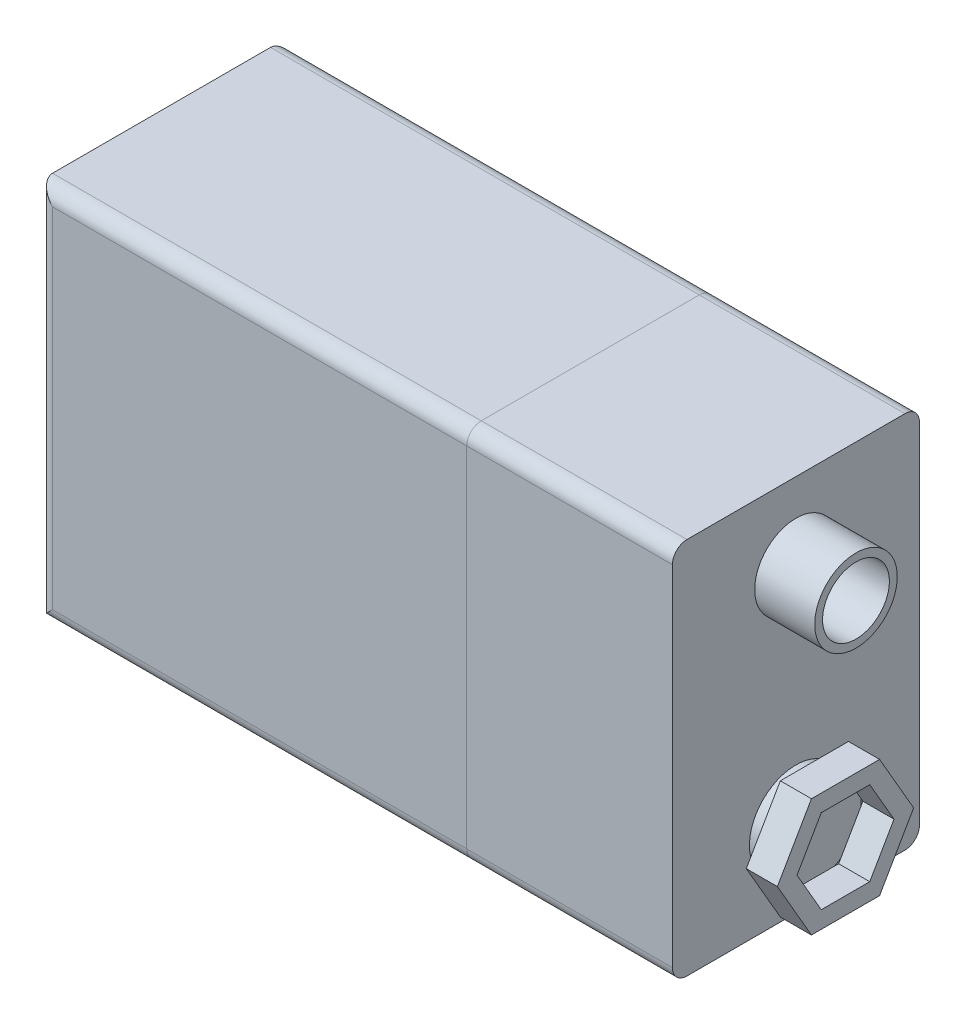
ISO-10303-21;
HEADER;
FILE_DESCRIPTION(('STEP AP214'),'2;1');
FILE_NAME('part.step','',(''),(''),'','','');
FILE_SCHEMA(('AUTOMOTIVE_DESIGN { 1 0 10303 214 1 1 1 1 }'));
ENDSEC;
DATA;
#1=APPLICATION_CONTEXT('core data for automotive mechanical design processes');
#2=APPLICATION_PROTOCOL_DEFINITION('international standard','automotive_design',2000,#1);
#3=PRODUCT_CONTEXT('',#1,'mechanical');
#4=PRODUCT('Part','Part','',(#3));
#5=PRODUCT_RELATED_PRODUCT_CATEGORY('part','',(#4));
#6=PRODUCT_DEFINITION_FORMATION('','',#4);
#7=PRODUCT_DEFINITION_CONTEXT('part definition',#1,'design');
#8=PRODUCT_DEFINITION('design','',#6,#7);
#9=PRODUCT_DEFINITION_SHAPE('','',#8);
#10=(LENGTH_UNIT() NAMED_UNIT(*) SI_UNIT(.MILLI.,.METRE.));
#11=(NAMED_UNIT(*) PLANE_ANGLE_UNIT() SI_UNIT($,.RADIAN.));
#12=(NAMED_UNIT(*) SI_UNIT($,.STERADIAN.) SOLID_ANGLE_UNIT());
#13=UNCERTAINTY_MEASURE_WITH_UNIT(LENGTH_MEASURE(1.E-05),#10,'distance_accuracy_value','');
#14=(GEOMETRIC_REPRESENTATION_CONTEXT(3) GLOBAL_UNCERTAINTY_ASSIGNED_CONTEXT((#13)) GLOBAL_UNIT_ASSIGNED_CONTEXT((#10,
#11,#12)) REPRESENTATION_CONTEXT('',''));
#15=CARTESIAN_POINT('',(0.,0.,0.));
#16=DIRECTION('',(0.,0.,1.));
#17=DIRECTION('',(1.,0.,0.));
#18=AXIS2_PLACEMENT_3D('',#15,#16,#17);
#19=CARTESIAN_POINT('',(44.92,5.63,-8.5));
#20=DIRECTION('',(1.,0.,0.));
#21=DIRECTION('',(0.,0.,-1.));
#22=AXIS2_PLACEMENT_3D('',#19,#20,#21);
#23=PLANE('',#22);
#24=CARTESIAN_POINT('',(44.92,5.63,-8.5));
#25=DIRECTION('',(1.,0.,0.));
#26=DIRECTION('',(0.,0.,-1.));
#27=AXIS2_PLACEMENT_3D('',#24,#25,#26);
#28=CIRCLE('',#27,3.2);
#29=CARTESIAN_POINT('',(44.92,2.74,-9.8740087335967));
#30=VERTEX_POINT('',#29);
#31=CARTESIAN_POINT('',(44.92,2.99507353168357,-10.3158090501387));
#32=VERTEX_POINT('',#31);
#33=EDGE_CURVE('E835',#30,#32,#28,.T.);
#34=ORIENTED_EDGE('',*,*,#33,.T.);
#35=DIRECTION('',(0.,0.866025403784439,-0.5));
#36=VECTOR('',#35,1.);
#37=CARTESIAN_POINT('',(44.92,2.74,-10.168542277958));
#38=LINE('',#37,#36);
#39=CARTESIAN_POINT('',(44.92,5.37492646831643,-11.6898177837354));
#40=VERTEX_POINT('',#39);
#41=EDGE_CURVE('E278',#32,#40,#38,.T.);
#42=ORIENTED_EDGE('',*,*,#41,.T.);
#43=CARTESIAN_POINT('',(44.92,5.88507353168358,-11.6898177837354));
#44=VERTEX_POINT('',#43);
#45=EDGE_CURVE('E360',#40,#44,#28,.T.);
#46=ORIENTED_EDGE('',*,*,#45,.T.);
#47=DIRECTION('',(0.,0.866025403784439,0.5));
#48=VECTOR('',#47,1.);
#49=CARTESIAN_POINT('',(44.92,5.63,-11.837084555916));
#50=LINE('',#49,#48);
#51=CARTESIAN_POINT('',(44.92,8.26492646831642,-10.3158090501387));
#52=VERTEX_POINT('',#51);
#53=EDGE_CURVE('E281',#44,#52,#50,.T.);
#54=ORIENTED_EDGE('',*,*,#53,.T.);
#55=CARTESIAN_POINT('',(44.92,8.52,-9.8740087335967));
#56=VERTEX_POINT('',#55);
#57=EDGE_CURVE('E359',#52,#56,#28,.T.);
#58=ORIENTED_EDGE('',*,*,#57,.T.);
#59=DIRECTION('',(0.,0.,1.));
#60=VECTOR('',#59,1.);
#61=CARTESIAN_POINT('',(44.92,8.52,-10.168542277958));
#62=LINE('',#61,#60);
#63=CARTESIAN_POINT('',(44.92,8.52,-7.12599126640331));
#64=VERTEX_POINT('',#63);
#65=EDGE_CURVE('E286',#56,#64,#62,.T.);
#66=ORIENTED_EDGE('',*,*,#65,.T.);
#67=CARTESIAN_POINT('',(44.92,8.26492646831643,-6.68419094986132));
#68=VERTEX_POINT('',#67);
#69=EDGE_CURVE('E816',#64,#68,#28,.T.);
#70=ORIENTED_EDGE('',*,*,#69,.T.);
#71=DIRECTION('',(0.,-0.866025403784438,0.5));
#72=VECTOR('',#71,1.);
#73=CARTESIAN_POINT('',(44.92,8.52,-6.83145772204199));
#74=LINE('',#73,#72);
#75=CARTESIAN_POINT('',(44.92,5.88507353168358,-5.31018221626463));
#76=VERTEX_POINT('',#75);
#77=EDGE_CURVE('E291',#68,#76,#74,.T.);
#78=ORIENTED_EDGE('',*,*,#77,.T.);
#79=CARTESIAN_POINT('',(44.92,5.37492646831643,-5.31018221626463));
#80=VERTEX_POINT('',#79);
#81=EDGE_CURVE('E821',#76,#80,#28,.T.);
#82=ORIENTED_EDGE('',*,*,#81,.T.);
#83=DIRECTION('',(0.,-0.866025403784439,-0.5));
#84=VECTOR('',#83,1.);
#85=CARTESIAN_POINT('',(44.92,5.63,-5.16291544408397));
#86=LINE('',#85,#84);
#87=CARTESIAN_POINT('',(44.92,2.99507353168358,-6.68419094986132));
#88=VERTEX_POINT('',#87);
#89=EDGE_CURVE('E296',#80,#88,#86,.T.);
#90=ORIENTED_EDGE('',*,*,#89,.T.);
#91=CARTESIAN_POINT('',(44.92,2.74,-7.1259912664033));
#92=VERTEX_POINT('',#91);
#93=EDGE_CURVE('E828',#88,#92,#28,.T.);
#94=ORIENTED_EDGE('',*,*,#93,.T.);
#95=DIRECTION('',(0.,0.,-1.));
#96=VECTOR('',#95,1.);
#97=CARTESIAN_POINT('',(44.92,2.74,-6.83145772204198));
#98=LINE('',#97,#96);
#99=EDGE_CURVE('E299',#92,#30,#98,.T.);
#100=ORIENTED_EDGE('',*,*,#99,.T.);
#101=EDGE_LOOP('',(#34,#42,#46,#54,#58,#66,#70,#78,#82,#90,#94,#100));
#102=FACE_BOUND('',#101,.T.);
#103=ADVANCED_FACE('F61',(#102),#23,.T.);
#104=CARTESIAN_POINT('',(43.65,26.008,0.));
#105=DIRECTION('',(0.,0.,-1.));
#106=DIRECTION('',(-1.,0.,0.));
#107=AXIS2_PLACEMENT_3D('',#104,#105,#106);
#108=PLANE('',#107);
#109=DIRECTION('',(0.,-1.,0.));
#110=VECTOR('',#109,1.);
#111=CARTESIAN_POINT('',(29.5,26.008,0.));
#112=LINE('',#111,#110);
#113=CARTESIAN_POINT('',(29.5,25.008,0.));
#114=VERTEX_POINT('',#113);
#115=CARTESIAN_POINT('',(29.5,1.,0.));
#116=VERTEX_POINT('',#115);
#117=EDGE_CURVE('E369',#114,#116,#112,.T.);
#118=ORIENTED_EDGE('',*,*,#117,.T.);
#119=DIRECTION('',(-1.,0.,0.));
#120=VECTOR('',#119,1.);
#121=CARTESIAN_POINT('',(43.65,1.,0.));
#122=LINE('',#121,#120);
#123=CARTESIAN_POINT('',(43.65,1.,0.));
#124=VERTEX_POINT('',#123);
#125=EDGE_CURVE('E411',#116,#124,#122,.F.);
#126=ORIENTED_EDGE('',*,*,#125,.T.);
#127=DIRECTION('',(0.,-1.,0.));
#128=VECTOR('',#127,1.);
#129=CARTESIAN_POINT('',(43.65,26.008,0.));
#130=LINE('',#129,#128);
#131=CARTESIAN_POINT('',(43.65,25.008,0.));
#132=VERTEX_POINT('',#131);
#133=EDGE_CURVE('E372',#132,#124,#130,.T.);
#134=ORIENTED_EDGE('',*,*,#133,.F.);
#135=DIRECTION('',(-1.,0.,0.));
#136=VECTOR('',#135,1.);
#137=CARTESIAN_POINT('',(43.65,25.008,0.));
#138=LINE('',#137,#136);
#139=EDGE_CURVE('E408',#132,#114,#138,.T.);
#140=ORIENTED_EDGE('',*,*,#139,.T.);
#141=EDGE_LOOP('',(#118,#126,#134,#140));
#142=FACE_BOUND('',#141,.T.);
#143=ADVANCED_FACE('F447',(#142),#108,.F.);
#144=CARTESIAN_POINT('',(43.65,0.,0.));
#145=DIRECTION('',(0.,1.,0.));
#146=DIRECTION('',(0.,0.,1.));
#147=AXIS2_PLACEMENT_3D('',#144,#145,#146);
#148=PLANE('',#147);
#149=DIRECTION('',(0.,0.,-1.));
#150=VECTOR('',#149,1.);
#151=CARTESIAN_POINT('',(43.65,0.,0.));
#152=LINE('',#151,#150);
#153=CARTESIAN_POINT('',(43.65,0.,-1.));
#154=VERTEX_POINT('',#153);
#155=CARTESIAN_POINT('',(43.65,0.,-16.));
#156=VERTEX_POINT('',#155);
#157=EDGE_CURVE('E375',#154,#156,#152,.T.);
#158=ORIENTED_EDGE('',*,*,#157,.F.);
#159=DIRECTION('',(-1.,0.,0.));
#160=VECTOR('',#159,1.);
#161=CARTESIAN_POINT('',(43.65,0.,-1.));
#162=LINE('',#161,#160);
#163=CARTESIAN_POINT('',(29.5,0.,-1.));
#164=VERTEX_POINT('',#163);
#165=EDGE_CURVE('E397',#154,#164,#162,.T.);
#166=ORIENTED_EDGE('',*,*,#165,.T.);
#167=DIRECTION('',(0.,0.,-1.));
#168=VECTOR('',#167,1.);
#169=CARTESIAN_POINT('',(29.5,0.,0.));
#170=LINE('',#169,#168);
#171=CARTESIAN_POINT('',(29.5,0.,-16.));
#172=VERTEX_POINT('',#171);
#173=EDGE_CURVE('E386',#164,#172,#170,.T.);
#174=ORIENTED_EDGE('',*,*,#173,.T.);
#175=DIRECTION('',(-1.,0.,0.));
#176=VECTOR('',#175,1.);
#177=CARTESIAN_POINT('',(43.65,0.,-16.));
#178=LINE('',#177,#176);
#179=EDGE_CURVE('E395',#172,#156,#178,.F.);
#180=ORIENTED_EDGE('',*,*,#179,.T.);
#181=EDGE_LOOP('',(#158,#166,#174,#180));
#182=FACE_BOUND('',#181,.T.);
#183=ADVANCED_FACE('F455',(#182),#148,.F.);
#184=CARTESIAN_POINT('',(43.65,26.008,-17.));
#185=DIRECTION('',(0.,0.,1.));
#186=DIRECTION('',(1.,0.,0.));
#187=AXIS2_PLACEMENT_3D('',#184,#185,#186);
#188=PLANE('',#187);
#189=DIRECTION('',(0.,1.,0.));
#190=VECTOR('',#189,1.);
#191=CARTESIAN_POINT('',(43.65,26.008,-17.));
#192=LINE('',#191,#190);
#193=CARTESIAN_POINT('',(43.65,1.,-17.));
#194=VERTEX_POINT('',#193);
#195=CARTESIAN_POINT('',(43.65,25.008,-17.));
#196=VERTEX_POINT('',#195);
#197=EDGE_CURVE('E379',#194,#196,#192,.T.);
#198=ORIENTED_EDGE('',*,*,#197,.F.);
#199=DIRECTION('',(-1.,0.,0.));
#200=VECTOR('',#199,1.);
#201=CARTESIAN_POINT('',(43.65,1.,-17.));
#202=LINE('',#201,#200);
#203=CARTESIAN_POINT('',(29.5,1.,-17.));
#204=VERTEX_POINT('',#203);
#205=EDGE_CURVE('E422',#194,#204,#202,.T.);
#206=ORIENTED_EDGE('',*,*,#205,.T.);
#207=DIRECTION('',(0.,1.,0.));
#208=VECTOR('',#207,1.);
#209=CARTESIAN_POINT('',(29.5,26.008,-17.));
#210=LINE('',#209,#208);
#211=CARTESIAN_POINT('',(29.5,25.008,-17.));
#212=VERTEX_POINT('',#211);
#213=EDGE_CURVE('E389',#204,#212,#210,.T.);
#214=ORIENTED_EDGE('',*,*,#213,.T.);
#215=DIRECTION('',(-1.,0.,0.));
#216=VECTOR('',#215,1.);
#217=CARTESIAN_POINT('',(43.65,25.008,-17.));
#218=LINE('',#217,#216);
#219=EDGE_CURVE('E420',#212,#196,#218,.F.);
#220=ORIENTED_EDGE('',*,*,#219,.T.);
#221=EDGE_LOOP('',(#198,#206,#214,#220));
#222=FACE_BOUND('',#221,.T.);
#223=ADVANCED_FACE('F428',(#222),#188,.F.);
#224=CARTESIAN_POINT('',(43.65,26.008,0.));
#225=DIRECTION('',(0.,-1.,0.));
#226=DIRECTION('',(0.,0.,-1.));
#227=AXIS2_PLACEMENT_3D('',#224,#225,#226);
#228=PLANE('',#227);
#229=DIRECTION('',(0.,0.,1.));
#230=VECTOR('',#229,1.);
#231=CARTESIAN_POINT('',(43.65,26.008,0.));
#232=LINE('',#231,#230);
#233=CARTESIAN_POINT('',(43.65,26.008,-16.));
#234=VERTEX_POINT('',#233);
#235=CARTESIAN_POINT('',(43.65,26.008,-1.));
#236=VERTEX_POINT('',#235);
#237=EDGE_CURVE('E381',#234,#236,#232,.T.);
#238=ORIENTED_EDGE('',*,*,#237,.F.);
#239=DIRECTION('',(-1.,0.,0.));
#240=VECTOR('',#239,1.);
#241=CARTESIAN_POINT('',(43.65,26.008,-16.));
#242=LINE('',#241,#240);
#243=CARTESIAN_POINT('',(29.5,26.008,-16.));
#244=VERTEX_POINT('',#243);
#245=EDGE_CURVE('E12',#234,#244,#242,.T.);
#246=ORIENTED_EDGE('',*,*,#245,.T.);
#247=DIRECTION('',(0.,0.,1.));
#248=VECTOR('',#247,1.);
#249=CARTESIAN_POINT('',(29.5,26.008,0.));
#250=LINE('',#249,#248);
#251=CARTESIAN_POINT('',(29.5,26.008,-1.));
#252=VERTEX_POINT('',#251);
#253=EDGE_CURVE('E376',#244,#252,#250,.T.);
#254=ORIENTED_EDGE('',*,*,#253,.T.);
#255=DIRECTION('',(-1.,0.,0.));
#256=VECTOR('',#255,1.);
#257=CARTESIAN_POINT('',(43.65,26.008,-1.));
#258=LINE('',#257,#256);
#259=EDGE_CURVE('E69',#252,#236,#258,.F.);
#260=ORIENTED_EDGE('',*,*,#259,.T.);
#261=EDGE_LOOP('',(#238,#246,#254,#260));
#262=FACE_BOUND('',#261,.T.);
#263=ADVANCED_FACE('F439',(#262),#228,.F.);
#264=CARTESIAN_POINT('',(43.65,0.,0.));
#265=DIRECTION('',(1.,0.,0.));
#266=DIRECTION('',(0.,0.,-1.));
#267=AXIS2_PLACEMENT_3D('',#264,#265,#266);
#268=PLANE('',#267);
#269=CARTESIAN_POINT('',(43.65,5.63,-8.5));
#270=DIRECTION('',(1.,0.,0.));
#271=DIRECTION('',(0.,0.,-1.));
#272=AXIS2_PLACEMENT_3D('',#269,#270,#271);
#273=CIRCLE('',#272,3.2);
#274=CARTESIAN_POINT('',(43.65,5.63,-11.7));
#275=VERTEX_POINT('',#274);
#276=EDGE_CURVE('E354',#275,#275,#273,.T.);
#277=ORIENTED_EDGE('',*,*,#276,.F.);
#278=EDGE_LOOP('',(#277));
#279=FACE_BOUND('',#278,.T.);
#280=CARTESIAN_POINT('',(43.65,20.688,-8.5));
#281=DIRECTION('',(1.,0.,0.));
#282=DIRECTION('',(0.,0.,-1.));
#283=AXIS2_PLACEMENT_3D('',#280,#281,#282);
#284=CIRCLE('',#283,2.84);
#285=CARTESIAN_POINT('',(43.65,20.688,-11.34));
#286=VERTEX_POINT('',#285);
#287=EDGE_CURVE('E365',#286,#286,#284,.T.);
#288=ORIENTED_EDGE('',*,*,#287,.F.);
#289=EDGE_LOOP('',(#288));
#290=FACE_BOUND('',#289,.T.);
#291=ORIENTED_EDGE('',*,*,#133,.T.);
#292=CARTESIAN_POINT('',(43.65,1.,-1.));
#293=DIRECTION('',(1.,0.,0.));
#294=DIRECTION('',(0.,0.,-1.));
#295=AXIS2_PLACEMENT_3D('',#292,#293,#294);
#296=CIRCLE('',#295,1.);
#297=EDGE_CURVE('E418',#124,#154,#296,.T.);
#298=ORIENTED_EDGE('',*,*,#297,.T.);
#299=ORIENTED_EDGE('',*,*,#157,.T.);
#300=CARTESIAN_POINT('',(43.65,1.,-16.));
#301=DIRECTION('',(1.,0.,0.));
#302=DIRECTION('',(0.,0.,-1.));
#303=AXIS2_PLACEMENT_3D('',#300,#301,#302);
#304=CIRCLE('',#303,1.);
#305=EDGE_CURVE('E416',#156,#194,#304,.T.);
#306=ORIENTED_EDGE('',*,*,#305,.T.);
#307=ORIENTED_EDGE('',*,*,#197,.T.);
#308=CARTESIAN_POINT('',(43.65,25.008,-16.));
#309=DIRECTION('',(1.,0.,0.));
#310=DIRECTION('',(0.,0.,-1.));
#311=AXIS2_PLACEMENT_3D('',#308,#309,#310);
#312=CIRCLE('',#311,1.);
#313=EDGE_CURVE('E82',#196,#234,#312,.T.);
#314=ORIENTED_EDGE('',*,*,#313,.T.);
#315=ORIENTED_EDGE('',*,*,#237,.T.);
#316=CARTESIAN_POINT('',(43.65,25.008,-1.));
#317=DIRECTION('',(1.,0.,0.));
#318=DIRECTION('',(0.,0.,-1.));
#319=AXIS2_PLACEMENT_3D('',#316,#317,#318);
#320=CIRCLE('',#319,1.);
#321=EDGE_CURVE('E413',#236,#132,#320,.T.);
#322=ORIENTED_EDGE('',*,*,#321,.T.);
#323=EDGE_LOOP('',(#291,#298,#299,#306,#307,#314,#315,#322));
#324=FACE_BOUND('',#323,.T.);
#325=ADVANCED_FACE('F441',(#279,#290,#324),#268,.T.);
#326=CARTESIAN_POINT('',(29.5,0.,0.));
#327=DIRECTION('',(1.,0.,0.));
#328=DIRECTION('',(0.,0.,-1.));
#329=AXIS2_PLACEMENT_3D('',#326,#327,#328);
#330=PLANE('',#329);
#331=ORIENTED_EDGE('',*,*,#173,.F.);
#332=CARTESIAN_POINT('',(29.5,1.,-1.));
#333=DIRECTION('',(1.,0.,0.));
#334=DIRECTION('',(0.,0.,-1.));
#335=AXIS2_PLACEMENT_3D('',#332,#333,#334);
#336=CIRCLE('',#335,1.);
#337=EDGE_CURVE('E406',#164,#116,#336,.F.);
#338=ORIENTED_EDGE('',*,*,#337,.T.);
#339=ORIENTED_EDGE('',*,*,#117,.F.);
#340=CARTESIAN_POINT('',(29.5,25.008,-1.));
#341=DIRECTION('',(1.,0.,0.));
#342=DIRECTION('',(0.,0.,-1.));
#343=AXIS2_PLACEMENT_3D('',#340,#341,#342);
#344=CIRCLE('',#343,1.);
#345=EDGE_CURVE('E400',#114,#252,#344,.F.);
#346=ORIENTED_EDGE('',*,*,#345,.T.);
#347=ORIENTED_EDGE('',*,*,#253,.F.);
#348=CARTESIAN_POINT('',(29.5,25.008,-16.));
#349=DIRECTION('',(1.,0.,0.));
#350=DIRECTION('',(0.,0.,-1.));
#351=AXIS2_PLACEMENT_3D('',#348,#349,#350);
#352=CIRCLE('',#351,1.);
#353=EDGE_CURVE('E402',#244,#212,#352,.F.);
#354=ORIENTED_EDGE('',*,*,#353,.T.);
#355=ORIENTED_EDGE('',*,*,#213,.F.);
#356=CARTESIAN_POINT('',(29.5,1.,-16.));
#357=DIRECTION('',(1.,0.,0.));
#358=DIRECTION('',(0.,0.,-1.));
#359=AXIS2_PLACEMENT_3D('',#356,#357,#358);
#360=CIRCLE('',#359,1.);
#361=EDGE_CURVE('E404',#204,#172,#360,.F.);
#362=ORIENTED_EDGE('',*,*,#361,.T.);
#363=EDGE_LOOP('',(#331,#338,#339,#346,#347,#354,#355,#362));
#364=FACE_BOUND('',#363,.T.);
#365=ADVANCED_FACE('F434',(#364),#330,.F.);
#366=CARTESIAN_POINT('',(47.78,20.688,-8.5));
#367=DIRECTION('',(1.,0.,0.));
#368=DIRECTION('',(0.,0.,-1.));
#369=AXIS2_PLACEMENT_3D('',#366,#367,#368);
#370=PLANE('',#369);
#371=CARTESIAN_POINT('',(47.78,20.688,-8.5));
#372=DIRECTION('',(1.,0.,0.));
#373=DIRECTION('',(0.,0.,-1.));
#374=AXIS2_PLACEMENT_3D('',#371,#372,#373);
#375=CIRCLE('',#374,2.84);
#376=CARTESIAN_POINT('',(47.78,20.688,-11.34));
#377=VERTEX_POINT('',#376);
#378=EDGE_CURVE('E366',#377,#377,#375,.T.);
#379=ORIENTED_EDGE('',*,*,#378,.T.);
#380=EDGE_LOOP('',(#379));
#381=FACE_BOUND('',#380,.T.);
#382=CARTESIAN_POINT('',(47.78,20.688,-8.5));
#383=DIRECTION('',(1.,0.,0.));
#384=DIRECTION('',(0.,0.,-1.));
#385=AXIS2_PLACEMENT_3D('',#382,#383,#384);
#386=CIRCLE('',#385,2.3);
#387=CARTESIAN_POINT('',(47.78,20.688,-10.8));
#388=VERTEX_POINT('',#387);
#389=EDGE_CURVE('E358',#388,#388,#386,.T.);
#390=ORIENTED_EDGE('',*,*,#389,.F.);
#391=EDGE_LOOP('',(#390));
#392=FACE_BOUND('',#391,.T.);
#393=ADVANCED_FACE('F489',(#381,#392),#370,.T.);
#394=CARTESIAN_POINT('',(47.78,20.688,-8.5));
#395=DIRECTION('',(-1.,0.,0.));
#396=DIRECTION('',(0.,0.,1.));
#397=AXIS2_PLACEMENT_3D('',#394,#395,#396);
#398=CYLINDRICAL_SURFACE('',#397,2.84);
#399=ORIENTED_EDGE('',*,*,#378,.F.);
#400=EDGE_LOOP('',(#399));
#401=FACE_BOUND('',#400,.T.);
#402=ORIENTED_EDGE('',*,*,#287,.T.);
#403=EDGE_LOOP('',(#402));
#404=FACE_BOUND('',#403,.T.);
#405=ADVANCED_FACE('F487',(#401,#404),#398,.T.);
#406=CARTESIAN_POINT('',(47.78,20.688,-8.5));
#407=DIRECTION('',(-1.,0.,0.));
#408=DIRECTION('',(0.,0.,1.));
#409=AXIS2_PLACEMENT_3D('',#406,#407,#408);
#410=CYLINDRICAL_SURFACE('',#409,2.3);
#411=ORIENTED_EDGE('',*,*,#389,.T.);
#412=EDGE_LOOP('',(#411));
#413=FACE_BOUND('',#412,.T.);
#414=CARTESIAN_POINT('',(43.65,20.688,-8.5));
#415=DIRECTION('',(1.,0.,0.));
#416=DIRECTION('',(0.,0.,-1.));
#417=AXIS2_PLACEMENT_3D('',#414,#415,#416);
#418=CIRCLE('',#417,2.3);
#419=CARTESIAN_POINT('',(43.65,20.688,-10.8));
#420=VERTEX_POINT('',#419);
#421=EDGE_CURVE('E383',#420,#420,#418,.F.);
#422=ORIENTED_EDGE('',*,*,#421,.T.);
#423=EDGE_LOOP('',(#422));
#424=FACE_BOUND('',#423,.T.);
#425=ADVANCED_FACE('F484',(#413,#424),#410,.F.);
#426=ORIENTED_EDGE('',*,*,#421,.F.);
#427=EDGE_LOOP('',(#426));
#428=FACE_BOUND('',#427,.T.);
#429=ADVANCED_FACE('F482',(#428),#268,.T.);
#430=CARTESIAN_POINT('',(44.92,5.63,-8.5));
#431=DIRECTION('',(-1.,0.,0.));
#432=DIRECTION('',(0.,0.,1.));
#433=AXIS2_PLACEMENT_3D('',#430,#431,#432);
#434=CYLINDRICAL_SURFACE('',#433,3.2);
#435=EDGE_CURVE('E355',#44,#52,#28,.T.);
#436=ORIENTED_EDGE('',*,*,#435,.F.);
#437=ORIENTED_EDGE('',*,*,#45,.F.);
#438=EDGE_CURVE('E809',#32,#40,#28,.T.);
#439=ORIENTED_EDGE('',*,*,#438,.F.);
#440=ORIENTED_EDGE('',*,*,#33,.F.);
#441=EDGE_CURVE('E831',#92,#30,#28,.T.);
#442=ORIENTED_EDGE('',*,*,#441,.F.);
#443=ORIENTED_EDGE('',*,*,#93,.F.);
#444=EDGE_CURVE('E824',#80,#88,#28,.T.);
#445=ORIENTED_EDGE('',*,*,#444,.F.);
#446=ORIENTED_EDGE('',*,*,#81,.F.);
#447=EDGE_CURVE('E818',#68,#76,#28,.T.);
#448=ORIENTED_EDGE('',*,*,#447,.F.);
#449=ORIENTED_EDGE('',*,*,#69,.F.);
#450=EDGE_CURVE('E814',#56,#64,#28,.T.);
#451=ORIENTED_EDGE('',*,*,#450,.F.);
#452=ORIENTED_EDGE('',*,*,#57,.F.);
#453=EDGE_LOOP('',(#436,#437,#439,#440,#442,#443,#445,#446,#448,#449,#451,#452));
#454=FACE_BOUND('',#453,.T.);
#455=ORIENTED_EDGE('',*,*,#276,.T.);
#456=EDGE_LOOP('',(#455));
#457=FACE_BOUND('',#456,.T.);
#458=ADVANCED_FACE('F478',(#454,#457),#434,.T.);
#459=CARTESIAN_POINT('',(44.92,0.,0.));
#460=DIRECTION('',(1.,0.,0.));
#461=DIRECTION('',(0.,0.,-1.));
#462=AXIS2_PLACEMENT_3D('',#459,#460,#461);
#463=PLANE('',#462);
#464=DIRECTION('',(0.,0.866025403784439,-0.5));
#465=VECTOR('',#464,1.);
#466=CARTESIAN_POINT('',(44.92,1.57,-10.8440420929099));
#467=LINE('',#466,#465);
#468=CARTESIAN_POINT('',(44.92,1.57,-10.8440420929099));
#469=VERTEX_POINT('',#468);
#470=CARTESIAN_POINT('',(44.92,5.63,-13.1880841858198));
#471=VERTEX_POINT('',#470);
#472=EDGE_CURVE('E256',#469,#471,#467,.T.);
#473=ORIENTED_EDGE('',*,*,#472,.F.);
#474=DIRECTION('',(0.,0.,-1.));
#475=VECTOR('',#474,1.);
#476=CARTESIAN_POINT('',(44.92,1.57,-6.15595790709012));
#477=LINE('',#476,#475);
#478=CARTESIAN_POINT('',(44.92,1.57,-6.15595790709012));
#479=VERTEX_POINT('',#478);
#480=EDGE_CURVE('E315',#479,#469,#477,.T.);
#481=ORIENTED_EDGE('',*,*,#480,.F.);
#482=DIRECTION('',(0.,-0.866025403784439,-0.5));
#483=VECTOR('',#482,1.);
#484=CARTESIAN_POINT('',(44.92,5.63,-3.81191581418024));
#485=LINE('',#484,#483);
#486=CARTESIAN_POINT('',(44.92,5.63,-3.81191581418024));
#487=VERTEX_POINT('',#486);
#488=EDGE_CURVE('E334',#487,#479,#485,.T.);
#489=ORIENTED_EDGE('',*,*,#488,.F.);
#490=DIRECTION('',(0.,-0.866025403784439,0.5));
#491=VECTOR('',#490,1.);
#492=CARTESIAN_POINT('',(44.92,9.69,-6.15595790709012));
#493=LINE('',#492,#491);
#494=CARTESIAN_POINT('',(44.92,9.69,-6.15595790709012));
#495=VERTEX_POINT('',#494);
#496=EDGE_CURVE('E332',#495,#487,#493,.T.);
#497=ORIENTED_EDGE('',*,*,#496,.F.);
#498=DIRECTION('',(0.,0.,1.));
#499=VECTOR('',#498,1.);
#500=CARTESIAN_POINT('',(44.92,9.69,-10.8440420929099));
#501=LINE('',#500,#499);
#502=CARTESIAN_POINT('',(44.92,9.69,-10.8440420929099));
#503=VERTEX_POINT('',#502);
#504=EDGE_CURVE('E330',#503,#495,#501,.T.);
#505=ORIENTED_EDGE('',*,*,#504,.F.);
#506=DIRECTION('',(0.,0.866025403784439,0.5));
#507=VECTOR('',#506,1.);
#508=CARTESIAN_POINT('',(44.92,5.63,-13.1880841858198));
#509=LINE('',#508,#507);
#510=EDGE_CURVE('E328',#471,#503,#509,.T.);
#511=ORIENTED_EDGE('',*,*,#510,.F.);
#512=EDGE_LOOP('',(#473,#481,#489,#497,#505,#511));
#513=FACE_BOUND('',#512,.T.);
#514=CARTESIAN_POINT('',(44.92,5.63,-11.837084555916));
#515=VERTEX_POINT('',#514);
#516=EDGE_CURVE('E255',#515,#44,#50,.T.);
#517=ORIENTED_EDGE('',*,*,#516,.T.);
#518=ORIENTED_EDGE('',*,*,#435,.T.);
#519=CARTESIAN_POINT('',(44.92,8.52,-10.168542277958));
#520=VERTEX_POINT('',#519);
#521=EDGE_CURVE('E276',#52,#520,#50,.T.);
#522=ORIENTED_EDGE('',*,*,#521,.T.);
#523=EDGE_CURVE('E282',#520,#56,#62,.T.);
#524=ORIENTED_EDGE('',*,*,#523,.T.);
#525=ORIENTED_EDGE('',*,*,#450,.T.);
#526=CARTESIAN_POINT('',(44.92,8.52,-6.83145772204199));
#527=VERTEX_POINT('',#526);
#528=EDGE_CURVE('E280',#64,#527,#62,.T.);
#529=ORIENTED_EDGE('',*,*,#528,.T.);
#530=EDGE_CURVE('E287',#527,#68,#74,.T.);
#531=ORIENTED_EDGE('',*,*,#530,.T.);
#532=ORIENTED_EDGE('',*,*,#447,.T.);
#533=CARTESIAN_POINT('',(44.92,5.63,-5.16291544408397));
#534=VERTEX_POINT('',#533);
#535=EDGE_CURVE('E285',#76,#534,#74,.T.);
#536=ORIENTED_EDGE('',*,*,#535,.T.);
#537=EDGE_CURVE('E292',#534,#80,#86,.T.);
#538=ORIENTED_EDGE('',*,*,#537,.T.);
#539=ORIENTED_EDGE('',*,*,#444,.T.);
#540=CARTESIAN_POINT('',(44.92,2.74,-6.83145772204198));
#541=VERTEX_POINT('',#540);
#542=EDGE_CURVE('E290',#88,#541,#86,.T.);
#543=ORIENTED_EDGE('',*,*,#542,.T.);
#544=EDGE_CURVE('E247',#541,#92,#98,.T.);
#545=ORIENTED_EDGE('',*,*,#544,.T.);
#546=ORIENTED_EDGE('',*,*,#441,.T.);
#547=CARTESIAN_POINT('',(44.92,2.74,-10.168542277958));
#548=VERTEX_POINT('',#547);
#549=EDGE_CURVE('E295',#30,#548,#98,.T.);
#550=ORIENTED_EDGE('',*,*,#549,.T.);
#551=EDGE_CURVE('E273',#548,#32,#38,.T.);
#552=ORIENTED_EDGE('',*,*,#551,.T.);
#553=ORIENTED_EDGE('',*,*,#438,.T.);
#554=EDGE_CURVE('E277',#40,#515,#38,.T.);
#555=ORIENTED_EDGE('',*,*,#554,.T.);
#556=EDGE_LOOP('',(#517,#518,#522,#524,#525,#529,#531,#532,#536,#538,#539,#543,#545,#546,#550,
#552,#553,#555));
#557=FACE_BOUND('',#556,.T.);
#558=ADVANCED_FACE('F481',(#513,#557),#463,.F.);
#559=CARTESIAN_POINT('',(47.06,0.,0.));
#560=DIRECTION('',(1.,0.,0.));
#561=DIRECTION('',(0.,0.,-1.));
#562=AXIS2_PLACEMENT_3D('',#559,#560,#561);
#563=PLANE('',#562);
#564=DIRECTION('',(0.,0.866025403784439,-0.5));
#565=VECTOR('',#564,1.);
#566=CARTESIAN_POINT('',(47.06,1.57,-10.8440420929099));
#567=LINE('',#566,#565);
#568=CARTESIAN_POINT('',(47.06,1.57,-10.8440420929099));
#569=VERTEX_POINT('',#568);
#570=CARTESIAN_POINT('',(47.06,5.63,-13.1880841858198));
#571=VERTEX_POINT('',#570);
#572=EDGE_CURVE('E311',#569,#571,#567,.T.);
#573=ORIENTED_EDGE('',*,*,#572,.T.);
#574=DIRECTION('',(0.,0.866025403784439,0.5));
#575=VECTOR('',#574,1.);
#576=CARTESIAN_POINT('',(47.06,5.63,-13.1880841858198));
#577=LINE('',#576,#575);
#578=CARTESIAN_POINT('',(47.06,9.69,-10.8440420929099));
#579=VERTEX_POINT('',#578);
#580=EDGE_CURVE('E314',#571,#579,#577,.T.);
#581=ORIENTED_EDGE('',*,*,#580,.T.);
#582=DIRECTION('',(0.,0.,1.));
#583=VECTOR('',#582,1.);
#584=CARTESIAN_POINT('',(47.06,9.69,-10.8440420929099));
#585=LINE('',#584,#583);
#586=CARTESIAN_POINT('',(47.06,9.69,-6.15595790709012));
#587=VERTEX_POINT('',#586);
#588=EDGE_CURVE('E317',#579,#587,#585,.T.);
#589=ORIENTED_EDGE('',*,*,#588,.T.);
#590=DIRECTION('',(0.,-0.866025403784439,0.5));
#591=VECTOR('',#590,1.);
#592=CARTESIAN_POINT('',(47.06,9.69,-6.15595790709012));
#593=LINE('',#592,#591);
#594=CARTESIAN_POINT('',(47.06,5.63,-3.81191581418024));
#595=VERTEX_POINT('',#594);
#596=EDGE_CURVE('E319',#587,#595,#593,.T.);
#597=ORIENTED_EDGE('',*,*,#596,.T.);
#598=DIRECTION('',(0.,-0.866025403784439,-0.5));
#599=VECTOR('',#598,1.);
#600=CARTESIAN_POINT('',(47.06,5.63,-3.81191581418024));
#601=LINE('',#600,#599);
#602=CARTESIAN_POINT('',(47.06,1.57,-6.15595790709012));
#603=VERTEX_POINT('',#602);
#604=EDGE_CURVE('E321',#595,#603,#601,.T.);
#605=ORIENTED_EDGE('',*,*,#604,.T.);
#606=DIRECTION('',(0.,0.,-1.));
#607=VECTOR('',#606,1.);
#608=CARTESIAN_POINT('',(47.06,1.57,-6.15595790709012));
#609=LINE('',#608,#607);
#610=EDGE_CURVE('E323',#603,#569,#609,.T.);
#611=ORIENTED_EDGE('',*,*,#610,.T.);
#612=EDGE_LOOP('',(#573,#581,#589,#597,#605,#611));
#613=FACE_BOUND('',#612,.T.);
#614=DIRECTION('',(0.,0.866025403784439,0.5));
#615=VECTOR('',#614,1.);
#616=CARTESIAN_POINT('',(47.06,5.63,-11.837084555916));
#617=LINE('',#616,#615);
#618=CARTESIAN_POINT('',(47.06,5.63,-11.837084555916));
#619=VERTEX_POINT('',#618);
#620=CARTESIAN_POINT('',(47.06,8.52,-10.168542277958));
#621=VERTEX_POINT('',#620);
#622=EDGE_CURVE('E246',#619,#621,#617,.T.);
#623=ORIENTED_EDGE('',*,*,#622,.F.);
#624=DIRECTION('',(0.,0.866025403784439,-0.5));
#625=VECTOR('',#624,1.);
#626=CARTESIAN_POINT('',(47.06,2.74,-10.168542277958));
#627=LINE('',#626,#625);
#628=CARTESIAN_POINT('',(47.06,2.74,-10.168542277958));
#629=VERTEX_POINT('',#628);
#630=EDGE_CURVE('E236',#629,#619,#627,.T.);
#631=ORIENTED_EDGE('',*,*,#630,.F.);
#632=DIRECTION('',(0.,0.,-1.));
#633=VECTOR('',#632,1.);
#634=CARTESIAN_POINT('',(47.06,2.74,-6.83145772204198));
#635=LINE('',#634,#633);
#636=CARTESIAN_POINT('',(47.06,2.74,-6.83145772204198));
#637=VERTEX_POINT('',#636);
#638=EDGE_CURVE('E271',#637,#629,#635,.T.);
#639=ORIENTED_EDGE('',*,*,#638,.F.);
#640=DIRECTION('',(0.,-0.866025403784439,-0.5));
#641=VECTOR('',#640,1.);
#642=CARTESIAN_POINT('',(47.06,5.63,-5.16291544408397));
#643=LINE('',#642,#641);
#644=CARTESIAN_POINT('',(47.06,5.63,-5.16291544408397));
#645=VERTEX_POINT('',#644);
#646=EDGE_CURVE('E268',#645,#637,#643,.T.);
#647=ORIENTED_EDGE('',*,*,#646,.F.);
#648=DIRECTION('',(0.,-0.866025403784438,0.5));
#649=VECTOR('',#648,1.);
#650=CARTESIAN_POINT('',(47.06,8.52,-6.83145772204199));
#651=LINE('',#650,#649);
#652=CARTESIAN_POINT('',(47.06,8.52,-6.83145772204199));
#653=VERTEX_POINT('',#652);
#654=EDGE_CURVE('E264',#653,#645,#651,.T.);
#655=ORIENTED_EDGE('',*,*,#654,.F.);
#656=DIRECTION('',(0.,0.,1.));
#657=VECTOR('',#656,1.);
#658=CARTESIAN_POINT('',(47.06,8.52,-10.168542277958));
#659=LINE('',#658,#657);
#660=EDGE_CURVE('E262',#621,#653,#659,.T.);
#661=ORIENTED_EDGE('',*,*,#660,.F.);
#662=EDGE_LOOP('',(#623,#631,#639,#647,#655,#661));
#663=FACE_BOUND('',#662,.T.);
#664=ADVANCED_FACE('F260',(#613,#663),#563,.T.);
#665=CARTESIAN_POINT('',(47.06,1.57,-10.8440420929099));
#666=DIRECTION('',(0.,0.5,0.866025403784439));
#667=DIRECTION('',(0.,-0.866025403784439,0.5));
#668=AXIS2_PLACEMENT_3D('',#665,#666,#667);
#669=PLANE('',#668);
#670=ORIENTED_EDGE('',*,*,#472,.T.);
#671=DIRECTION('',(-1.,0.,0.));
#672=VECTOR('',#671,1.);
#673=CARTESIAN_POINT('',(47.06,5.63,-13.1880841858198));
#674=LINE('',#673,#672);
#675=EDGE_CURVE('E351',#571,#471,#674,.T.);
#676=ORIENTED_EDGE('',*,*,#675,.F.);
#677=ORIENTED_EDGE('',*,*,#572,.F.);
#678=DIRECTION('',(-1.,0.,0.));
#679=VECTOR('',#678,1.);
#680=CARTESIAN_POINT('',(47.06,1.57,-10.8440420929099));
#681=LINE('',#680,#679);
#682=EDGE_CURVE('E325',#569,#469,#681,.T.);
#683=ORIENTED_EDGE('',*,*,#682,.T.);
#684=EDGE_LOOP('',(#670,#676,#677,#683));
#685=FACE_BOUND('',#684,.T.);
#686=ADVANCED_FACE('F476',(#685),#669,.F.);
#687=CARTESIAN_POINT('',(47.06,5.63,-13.1880841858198));
#688=DIRECTION('',(0.,-0.5,0.866025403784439));
#689=DIRECTION('',(0.,-0.866025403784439,-0.5));
#690=AXIS2_PLACEMENT_3D('',#687,#688,#689);
#691=PLANE('',#690);
#692=ORIENTED_EDGE('',*,*,#510,.T.);
#693=DIRECTION('',(-1.,0.,0.));
#694=VECTOR('',#693,1.);
#695=CARTESIAN_POINT('',(47.06,9.69,-10.8440420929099));
#696=LINE('',#695,#694);
#697=EDGE_CURVE('E348',#579,#503,#696,.T.);
#698=ORIENTED_EDGE('',*,*,#697,.F.);
#699=ORIENTED_EDGE('',*,*,#580,.F.);
#700=ORIENTED_EDGE('',*,*,#675,.T.);
#701=EDGE_LOOP('',(#692,#698,#699,#700));
#702=FACE_BOUND('',#701,.T.);
#703=ADVANCED_FACE('F682',(#702),#691,.F.);
#704=CARTESIAN_POINT('',(47.06,9.69,-10.8440420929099));
#705=DIRECTION('',(0.,-1.,0.));
#706=DIRECTION('',(0.,0.,-1.));
#707=AXIS2_PLACEMENT_3D('',#704,#705,#706);
#708=PLANE('',#707);
#709=ORIENTED_EDGE('',*,*,#504,.T.);
#710=DIRECTION('',(-1.,0.,0.));
#711=VECTOR('',#710,1.);
#712=CARTESIAN_POINT('',(47.06,9.69,-6.15595790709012));
#713=LINE('',#712,#711);
#714=EDGE_CURVE('E345',#587,#495,#713,.T.);
#715=ORIENTED_EDGE('',*,*,#714,.F.);
#716=ORIENTED_EDGE('',*,*,#588,.F.);
#717=ORIENTED_EDGE('',*,*,#697,.T.);
#718=EDGE_LOOP('',(#709,#715,#716,#717));
#719=FACE_BOUND('',#718,.T.);
#720=ADVANCED_FACE('F672',(#719),#708,.F.);
#721=CARTESIAN_POINT('',(47.06,9.69,-6.15595790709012));
#722=DIRECTION('',(0.,-0.5,-0.866025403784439));
#723=DIRECTION('',(0.,0.866025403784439,-0.5));
#724=AXIS2_PLACEMENT_3D('',#721,#722,#723);
#725=PLANE('',#724);
#726=ORIENTED_EDGE('',*,*,#496,.T.);
#727=DIRECTION('',(-1.,0.,0.));
#728=VECTOR('',#727,1.);
#729=CARTESIAN_POINT('',(47.06,5.63,-3.81191581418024));
#730=LINE('',#729,#728);
#731=EDGE_CURVE('E342',#595,#487,#730,.T.);
#732=ORIENTED_EDGE('',*,*,#731,.F.);
#733=ORIENTED_EDGE('',*,*,#596,.F.);
#734=ORIENTED_EDGE('',*,*,#714,.T.);
#735=EDGE_LOOP('',(#726,#732,#733,#734));
#736=FACE_BOUND('',#735,.T.);
#737=ADVANCED_FACE('F662',(#736),#725,.F.);
#738=CARTESIAN_POINT('',(47.06,5.63,-3.81191581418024));
#739=DIRECTION('',(0.,0.5,-0.866025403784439));
#740=DIRECTION('',(0.,0.866025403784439,0.5));
#741=AXIS2_PLACEMENT_3D('',#738,#739,#740);
#742=PLANE('',#741);
#743=ORIENTED_EDGE('',*,*,#488,.T.);
#744=DIRECTION('',(-1.,0.,0.));
#745=VECTOR('',#744,1.);
#746=CARTESIAN_POINT('',(47.06,1.57,-6.15595790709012));
#747=LINE('',#746,#745);
#748=EDGE_CURVE('E339',#603,#479,#747,.T.);
#749=ORIENTED_EDGE('',*,*,#748,.F.);
#750=ORIENTED_EDGE('',*,*,#604,.F.);
#751=ORIENTED_EDGE('',*,*,#731,.T.);
#752=EDGE_LOOP('',(#743,#749,#750,#751));
#753=FACE_BOUND('',#752,.T.);
#754=ADVANCED_FACE('F652',(#753),#742,.F.);
#755=CARTESIAN_POINT('',(47.06,1.57,-6.15595790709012));
#756=DIRECTION('',(0.,1.,0.));
#757=DIRECTION('',(0.,0.,1.));
#758=AXIS2_PLACEMENT_3D('',#755,#756,#757);
#759=PLANE('',#758);
#760=ORIENTED_EDGE('',*,*,#480,.T.);
#761=ORIENTED_EDGE('',*,*,#682,.F.);
#762=ORIENTED_EDGE('',*,*,#610,.F.);
#763=ORIENTED_EDGE('',*,*,#748,.T.);
#764=EDGE_LOOP('',(#760,#761,#762,#763));
#765=FACE_BOUND('',#764,.T.);
#766=ADVANCED_FACE('F643',(#765),#759,.F.);
#767=CARTESIAN_POINT('',(47.06,2.74,-10.168542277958));
#768=DIRECTION('',(0.,0.5,0.866025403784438));
#769=DIRECTION('',(0.,-0.866025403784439,0.5));
#770=AXIS2_PLACEMENT_3D('',#767,#768,#769);
#771=PLANE('',#770);
#772=ORIENTED_EDGE('',*,*,#551,.F.);
#773=DIRECTION('',(-1.,0.,0.));
#774=VECTOR('',#773,1.);
#775=CARTESIAN_POINT('',(47.06,2.74,-10.168542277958));
#776=LINE('',#775,#774);
#777=EDGE_CURVE('E242',#629,#548,#776,.T.);
#778=ORIENTED_EDGE('',*,*,#777,.F.);
#779=ORIENTED_EDGE('',*,*,#630,.T.);
#780=DIRECTION('',(-1.,0.,0.));
#781=VECTOR('',#780,1.);
#782=CARTESIAN_POINT('',(47.06,5.63,-11.837084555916));
#783=LINE('',#782,#781);
#784=EDGE_CURVE('E240',#619,#515,#783,.T.);
#785=ORIENTED_EDGE('',*,*,#784,.T.);
#786=ORIENTED_EDGE('',*,*,#554,.F.);
#787=ORIENTED_EDGE('',*,*,#41,.F.);
#788=EDGE_LOOP('',(#772,#778,#779,#785,#786,#787));
#789=FACE_BOUND('',#788,.T.);
#790=ADVANCED_FACE('F239',(#789),#771,.T.);
#791=CARTESIAN_POINT('',(47.06,5.63,-11.837084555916));
#792=DIRECTION('',(0.,-0.5,0.866025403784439));
#793=DIRECTION('',(0.,-0.866025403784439,-0.5));
#794=AXIS2_PLACEMENT_3D('',#791,#792,#793);
#795=PLANE('',#794);
#796=ORIENTED_EDGE('',*,*,#516,.F.);
#797=ORIENTED_EDGE('',*,*,#784,.F.);
#798=ORIENTED_EDGE('',*,*,#622,.T.);
#799=DIRECTION('',(-1.,0.,0.));
#800=VECTOR('',#799,1.);
#801=CARTESIAN_POINT('',(47.06,8.52,-10.168542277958));
#802=LINE('',#801,#800);
#803=EDGE_CURVE('E257',#621,#520,#802,.T.);
#804=ORIENTED_EDGE('',*,*,#803,.T.);
#805=ORIENTED_EDGE('',*,*,#521,.F.);
#806=ORIENTED_EDGE('',*,*,#53,.F.);
#807=EDGE_LOOP('',(#796,#797,#798,#804,#805,#806));
#808=FACE_BOUND('',#807,.T.);
#809=ADVANCED_FACE('F251',(#808),#795,.T.);
#810=CARTESIAN_POINT('',(47.06,8.52,-10.168542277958));
#811=DIRECTION('',(0.,-1.,0.));
#812=DIRECTION('',(0.,0.,-1.));
#813=AXIS2_PLACEMENT_3D('',#810,#811,#812);
#814=PLANE('',#813);
#815=ORIENTED_EDGE('',*,*,#523,.F.);
#816=ORIENTED_EDGE('',*,*,#803,.F.);
#817=ORIENTED_EDGE('',*,*,#660,.T.);
#818=DIRECTION('',(-1.,0.,0.));
#819=VECTOR('',#818,1.);
#820=CARTESIAN_POINT('',(47.06,8.52,-6.83145772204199));
#821=LINE('',#820,#819);
#822=EDGE_CURVE('E307',#653,#527,#821,.T.);
#823=ORIENTED_EDGE('',*,*,#822,.T.);
#824=ORIENTED_EDGE('',*,*,#528,.F.);
#825=ORIENTED_EDGE('',*,*,#65,.F.);
#826=EDGE_LOOP('',(#815,#816,#817,#823,#824,#825));
#827=FACE_BOUND('',#826,.T.);
#828=ADVANCED_FACE('F616',(#827),#814,.T.);
#829=CARTESIAN_POINT('',(47.06,8.52,-6.83145772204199));
#830=DIRECTION('',(0.,-0.5,-0.866025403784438));
#831=DIRECTION('',(0.,0.866025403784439,-0.5));
#832=AXIS2_PLACEMENT_3D('',#829,#830,#831);
#833=PLANE('',#832);
#834=ORIENTED_EDGE('',*,*,#530,.F.);
#835=ORIENTED_EDGE('',*,*,#822,.F.);
#836=ORIENTED_EDGE('',*,*,#654,.T.);
#837=DIRECTION('',(-1.,0.,0.));
#838=VECTOR('',#837,1.);
#839=CARTESIAN_POINT('',(47.06,5.63,-5.16291544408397));
#840=LINE('',#839,#838);
#841=EDGE_CURVE('E304',#645,#534,#840,.T.);
#842=ORIENTED_EDGE('',*,*,#841,.T.);
#843=ORIENTED_EDGE('',*,*,#535,.F.);
#844=ORIENTED_EDGE('',*,*,#77,.F.);
#845=EDGE_LOOP('',(#834,#835,#836,#842,#843,#844));
#846=FACE_BOUND('',#845,.T.);
#847=ADVANCED_FACE('F606',(#846),#833,.T.);
#848=CARTESIAN_POINT('',(47.06,5.63,-5.16291544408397));
#849=DIRECTION('',(0.,0.5,-0.866025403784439));
#850=DIRECTION('',(0.,0.866025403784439,0.5));
#851=AXIS2_PLACEMENT_3D('',#848,#849,#850);
#852=PLANE('',#851);
#853=ORIENTED_EDGE('',*,*,#537,.F.);
#854=ORIENTED_EDGE('',*,*,#841,.F.);
#855=ORIENTED_EDGE('',*,*,#646,.T.);
#856=DIRECTION('',(-1.,0.,0.));
#857=VECTOR('',#856,1.);
#858=CARTESIAN_POINT('',(47.06,2.74,-6.83145772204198));
#859=LINE('',#858,#857);
#860=EDGE_CURVE('E301',#637,#541,#859,.T.);
#861=ORIENTED_EDGE('',*,*,#860,.T.);
#862=ORIENTED_EDGE('',*,*,#542,.F.);
#863=ORIENTED_EDGE('',*,*,#89,.F.);
#864=EDGE_LOOP('',(#853,#854,#855,#861,#862,#863));
#865=FACE_BOUND('',#864,.T.);
#866=ADVANCED_FACE('F595',(#865),#852,.T.);
#867=CARTESIAN_POINT('',(47.06,2.74,-6.83145772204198));
#868=DIRECTION('',(0.,1.,0.));
#869=DIRECTION('',(0.,0.,1.));
#870=AXIS2_PLACEMENT_3D('',#867,#868,#869);
#871=PLANE('',#870);
#872=ORIENTED_EDGE('',*,*,#544,.F.);
#873=ORIENTED_EDGE('',*,*,#860,.F.);
#874=ORIENTED_EDGE('',*,*,#638,.T.);
#875=ORIENTED_EDGE('',*,*,#777,.T.);
#876=ORIENTED_EDGE('',*,*,#549,.F.);
#877=ORIENTED_EDGE('',*,*,#99,.F.);
#878=EDGE_LOOP('',(#872,#873,#874,#875,#876,#877));
#879=FACE_BOUND('',#878,.T.);
#880=ADVANCED_FACE('F464',(#879),#871,.T.);
#881=CARTESIAN_POINT('',(43.65,1.,-1.));
#882=DIRECTION('',(-1.,0.,0.));
#883=DIRECTION('',(0.,0.,1.));
#884=AXIS2_PLACEMENT_3D('',#881,#882,#883);
#885=CYLINDRICAL_SURFACE('',#884,1.);
#886=ORIENTED_EDGE('',*,*,#297,.F.);
#887=ORIENTED_EDGE('',*,*,#125,.F.);
#888=ORIENTED_EDGE('',*,*,#337,.F.);
#889=ORIENTED_EDGE('',*,*,#165,.F.);
#890=EDGE_LOOP('',(#886,#887,#888,#889));
#891=FACE_BOUND('',#890,.T.);
#892=ADVANCED_FACE('F452',(#891),#885,.T.);
#893=CARTESIAN_POINT('',(43.65,1.,-16.));
#894=DIRECTION('',(-1.,0.,0.));
#895=DIRECTION('',(0.,0.,1.));
#896=AXIS2_PLACEMENT_3D('',#893,#894,#895);
#897=CYLINDRICAL_SURFACE('',#896,1.);
#898=ORIENTED_EDGE('',*,*,#305,.F.);
#899=ORIENTED_EDGE('',*,*,#179,.F.);
#900=ORIENTED_EDGE('',*,*,#361,.F.);
#901=ORIENTED_EDGE('',*,*,#205,.F.);
#902=EDGE_LOOP('',(#898,#899,#900,#901));
#903=FACE_BOUND('',#902,.T.);
#904=ADVANCED_FACE('F457',(#903),#897,.T.);
#905=CARTESIAN_POINT('',(43.65,25.008,-16.));
#906=DIRECTION('',(-1.,0.,0.));
#907=DIRECTION('',(0.,0.,1.));
#908=AXIS2_PLACEMENT_3D('',#905,#906,#907);
#909=CYLINDRICAL_SURFACE('',#908,1.);
#910=ORIENTED_EDGE('',*,*,#313,.F.);
#911=ORIENTED_EDGE('',*,*,#219,.F.);
#912=ORIENTED_EDGE('',*,*,#353,.F.);
#913=ORIENTED_EDGE('',*,*,#245,.F.);
#914=EDGE_LOOP('',(#910,#911,#912,#913));
#915=FACE_BOUND('',#914,.T.);
#916=ADVANCED_FACE('F438',(#915),#909,.T.);
#917=CARTESIAN_POINT('',(43.65,25.008,-1.));
#918=DIRECTION('',(-1.,0.,0.));
#919=DIRECTION('',(0.,0.,1.));
#920=AXIS2_PLACEMENT_3D('',#917,#918,#919);
#921=CYLINDRICAL_SURFACE('',#920,1.);
#922=ORIENTED_EDGE('',*,*,#321,.F.);
#923=ORIENTED_EDGE('',*,*,#259,.F.);
#924=ORIENTED_EDGE('',*,*,#345,.F.);
#925=ORIENTED_EDGE('',*,*,#139,.F.);
#926=EDGE_LOOP('',(#922,#923,#924,#925));
#927=FACE_BOUND('',#926,.T.);
#928=ADVANCED_FACE('F63',(#927),#921,.T.);
#929=CLOSED_SHELL('',(#103,#143,#183,#223,#263,#325,#365,#393,#405,#425,#429,#458,#558,#664,
#686,#703,#720,#737,#754,#766,#790,#809,#828,#847,#866,#880,#892,#904,#916,#928));
#930=MANIFOLD_SOLID_BREP('B2',#929);
#931=CARTESIAN_POINT('',(0.,26.008,-17.));
#932=DIRECTION('',(1.,0.,0.));
#933=DIRECTION('',(0.,0.,-1.));
#934=AXIS2_PLACEMENT_3D('',#931,#932,#933);
#935=PLANE('',#934);
#936=DIRECTION('',(0.,0.,1.));
#937=VECTOR('',#936,1.);
#938=CARTESIAN_POINT('',(0.,0.,-17.));
#939=LINE('',#938,#937);
#940=CARTESIAN_POINT('',(0.,0.,-16.));
#941=VERTEX_POINT('',#940);
#942=CARTESIAN_POINT('',(0.,0.,-1.));
#943=VERTEX_POINT('',#942);
#944=EDGE_CURVE('E1011',#941,#943,#939,.T.);
#945=ORIENTED_EDGE('',*,*,#944,.T.);
#946=DIRECTION('',(0.,-1.,0.));
#947=VECTOR('',#946,1.);
#948=CARTESIAN_POINT('',(0.,26.008,-1.));
#949=LINE('',#948,#947);
#950=CARTESIAN_POINT('',(0.,26.008,-1.));
#951=VERTEX_POINT('',#950);
#952=EDGE_CURVE('E992',#943,#951,#949,.F.);
#953=ORIENTED_EDGE('',*,*,#952,.T.);
#954=DIRECTION('',(0.,0.,1.));
#955=VECTOR('',#954,1.);
#956=CARTESIAN_POINT('',(0.,26.008,-17.));
#957=LINE('',#956,#955);
#958=CARTESIAN_POINT('',(0.,26.008,-16.));
#959=VERTEX_POINT('',#958);
#960=EDGE_CURVE('E1029',#959,#951,#957,.T.);
#961=ORIENTED_EDGE('',*,*,#960,.F.);
#962=DIRECTION('',(0.,-1.,0.));
#963=VECTOR('',#962,1.);
#964=CARTESIAN_POINT('',(0.,26.008,-16.));
#965=LINE('',#964,#963);
#966=EDGE_CURVE('E989',#959,#941,#965,.T.);
#967=ORIENTED_EDGE('',*,*,#966,.T.);
#968=EDGE_LOOP('',(#945,#953,#961,#967));
#969=FACE_BOUND('',#968,.T.);
#970=ADVANCED_FACE('F871',(#969),#935,.F.);
#971=CARTESIAN_POINT('',(0.,26.008,0.));
#972=DIRECTION('',(0.,0.,-1.));
#973=DIRECTION('',(-1.,0.,0.));
#974=AXIS2_PLACEMENT_3D('',#971,#972,#973);
#975=PLANE('',#974);
#976=DIRECTION('',(0.,-1.,0.));
#977=VECTOR('',#976,1.);
#978=CARTESIAN_POINT('',(1.,26.008,0.));
#979=LINE('',#978,#977);
#980=CARTESIAN_POINT('',(1.,25.008,0.));
#981=VERTEX_POINT('',#980);
#982=CARTESIAN_POINT('',(1.,1.,0.));
#983=VERTEX_POINT('',#982);
#984=EDGE_CURVE('E968',#981,#983,#979,.T.);
#985=ORIENTED_EDGE('',*,*,#984,.T.);
#986=DIRECTION('',(1.,0.,0.));
#987=VECTOR('',#986,1.);
#988=CARTESIAN_POINT('',(0.,1.,0.));
#989=LINE('',#988,#987);
#990=CARTESIAN_POINT('',(29.5,1.,0.));
#991=VERTEX_POINT('',#990);
#992=EDGE_CURVE('E959',#983,#991,#989,.T.);
#993=ORIENTED_EDGE('',*,*,#992,.T.);
#994=DIRECTION('',(0.,-1.,0.));
#995=VECTOR('',#994,1.);
#996=CARTESIAN_POINT('',(29.5,26.008,0.));
#997=LINE('',#996,#995);
#998=CARTESIAN_POINT('',(29.5,25.008,0.));
#999=VERTEX_POINT('',#998);
#1000=EDGE_CURVE('E943',#999,#991,#997,.T.);
#1001=ORIENTED_EDGE('',*,*,#1000,.F.);
#1002=DIRECTION('',(1.,0.,0.));
#1003=VECTOR('',#1002,1.);
#1004=CARTESIAN_POINT('',(0.,25.008,0.));
#1005=LINE('',#1004,#1003);
#1006=EDGE_CURVE('E956',#999,#981,#1005,.F.);
#1007=ORIENTED_EDGE('',*,*,#1006,.T.);
#1008=EDGE_LOOP('',(#985,#993,#1001,#1007));
#1009=FACE_BOUND('',#1008,.T.);
#1010=ADVANCED_FACE('F955',(#1009),#975,.F.);
#1011=CARTESIAN_POINT('',(29.5,26.008,0.));
#1012=DIRECTION('',(-1.,0.,0.));
#1013=DIRECTION('',(0.,0.,1.));
#1014=AXIS2_PLACEMENT_3D('',#1011,#1012,#1013);
#1015=PLANE('',#1014);
#1016=ORIENTED_EDGE('',*,*,#1000,.T.);
#1017=CARTESIAN_POINT('',(29.5,1.,-1.));
#1018=DIRECTION('',(-1.,0.,0.));
#1019=DIRECTION('',(0.,0.,1.));
#1020=AXIS2_PLACEMENT_3D('',#1017,#1018,#1019);
#1021=CIRCLE('',#1020,1.);
#1022=CARTESIAN_POINT('',(29.5,0.,-1.));
#1023=VERTEX_POINT('',#1022);
#1024=EDGE_CURVE('E950',#991,#1023,#1021,.F.);
#1025=ORIENTED_EDGE('',*,*,#1024,.T.);
#1026=DIRECTION('',(0.,0.,-1.));
#1027=VECTOR('',#1026,1.);
#1028=CARTESIAN_POINT('',(29.5,0.,0.));
#1029=LINE('',#1028,#1027);
#1030=CARTESIAN_POINT('',(29.5,0.,-16.));
#1031=VERTEX_POINT('',#1030);
#1032=EDGE_CURVE('E1032',#1023,#1031,#1029,.T.);
#1033=ORIENTED_EDGE('',*,*,#1032,.T.);
#1034=CARTESIAN_POINT('',(29.5,1.,-16.));
#1035=DIRECTION('',(-1.,0.,0.));
#1036=DIRECTION('',(0.,0.,1.));
#1037=AXIS2_PLACEMENT_3D('',#1034,#1035,#1036);
#1038=CIRCLE('',#1037,1.);
#1039=CARTESIAN_POINT('',(29.5,1.,-17.));
#1040=VERTEX_POINT('',#1039);
#1041=EDGE_CURVE('E951',#1031,#1040,#1038,.F.);
#1042=ORIENTED_EDGE('',*,*,#1041,.T.);
#1043=DIRECTION('',(0.,-1.,0.));
#1044=VECTOR('',#1043,1.);
#1045=CARTESIAN_POINT('',(29.5,26.008,-17.));
#1046=LINE('',#1045,#1044);
#1047=CARTESIAN_POINT('',(29.5,25.008,-17.));
#1048=VERTEX_POINT('',#1047);
#1049=EDGE_CURVE('E961',#1048,#1040,#1046,.T.);
#1050=ORIENTED_EDGE('',*,*,#1049,.F.);
#1051=CARTESIAN_POINT('',(29.5,25.008,-16.));
#1052=DIRECTION('',(-1.,0.,0.));
#1053=DIRECTION('',(0.,0.,1.));
#1054=AXIS2_PLACEMENT_3D('',#1051,#1052,#1053);
#1055=CIRCLE('',#1054,1.);
#1056=CARTESIAN_POINT('',(29.5,26.008,-16.));
#1057=VERTEX_POINT('',#1056);
#1058=EDGE_CURVE('E976',#1048,#1057,#1055,.F.);
#1059=ORIENTED_EDGE('',*,*,#1058,.T.);
#1060=DIRECTION('',(0.,0.,-1.));
#1061=VECTOR('',#1060,1.);
#1062=CARTESIAN_POINT('',(29.5,26.008,0.));
#1063=LINE('',#1062,#1061);
#1064=CARTESIAN_POINT('',(29.5,26.008,-1.));
#1065=VERTEX_POINT('',#1064);
#1066=EDGE_CURVE('E945',#1065,#1057,#1063,.T.);
#1067=ORIENTED_EDGE('',*,*,#1066,.F.);
#1068=CARTESIAN_POINT('',(29.5,25.008,-1.));
#1069=DIRECTION('',(-1.,0.,0.));
#1070=DIRECTION('',(0.,0.,1.));
#1071=AXIS2_PLACEMENT_3D('',#1068,#1069,#1070);
#1072=CIRCLE('',#1071,1.);
#1073=EDGE_CURVE('E940',#1065,#999,#1072,.F.);
#1074=ORIENTED_EDGE('',*,*,#1073,.T.);
#1075=EDGE_LOOP('',(#1016,#1025,#1033,#1042,#1050,#1059,#1067,#1074));
#1076=FACE_BOUND('',#1075,.T.);
#1077=ADVANCED_FACE('F942',(#1076),#1015,.F.);
#1078=CARTESIAN_POINT('',(29.5,26.008,-17.));
#1079=DIRECTION('',(0.,0.,1.));
#1080=DIRECTION('',(1.,0.,0.));
#1081=AXIS2_PLACEMENT_3D('',#1078,#1079,#1080);
#1082=PLANE('',#1081);
#1083=ORIENTED_EDGE('',*,*,#1049,.T.);
#1084=DIRECTION('',(-1.,0.,0.));
#1085=VECTOR('',#1084,1.);
#1086=CARTESIAN_POINT('',(29.5,1.,-17.));
#1087=LINE('',#1086,#1085);
#1088=CARTESIAN_POINT('',(1.,1.,-17.));
#1089=VERTEX_POINT('',#1088);
#1090=EDGE_CURVE('E59',#1040,#1089,#1087,.T.);
#1091=ORIENTED_EDGE('',*,*,#1090,.T.);
#1092=DIRECTION('',(0.,-1.,0.));
#1093=VECTOR('',#1092,1.);
#1094=CARTESIAN_POINT('',(1.,26.008,-17.));
#1095=LINE('',#1094,#1093);
#1096=CARTESIAN_POINT('',(1.,25.008,-17.));
#1097=VERTEX_POINT('',#1096);
#1098=EDGE_CURVE('E881',#1089,#1097,#1095,.F.);
#1099=ORIENTED_EDGE('',*,*,#1098,.T.);
#1100=DIRECTION('',(-1.,0.,0.));
#1101=VECTOR('',#1100,1.);
#1102=CARTESIAN_POINT('',(29.5,25.008,-17.));
#1103=LINE('',#1102,#1101);
#1104=EDGE_CURVE('E1001',#1097,#1048,#1103,.F.);
#1105=ORIENTED_EDGE('',*,*,#1104,.T.);
#1106=EDGE_LOOP('',(#1083,#1091,#1099,#1105));
#1107=FACE_BOUND('',#1106,.T.);
#1108=ADVANCED_FACE('F1024',(#1107),#1082,.F.);
#1109=CARTESIAN_POINT('',(0.,26.008,0.));
#1110=DIRECTION('',(0.,1.,0.));
#1111=DIRECTION('',(0.,0.,1.));
#1112=AXIS2_PLACEMENT_3D('',#1109,#1110,#1111);
#1113=PLANE('',#1112);
#1114=ORIENTED_EDGE('',*,*,#960,.T.);
#1115=DIRECTION('',(1.,0.,0.));
#1116=VECTOR('',#1115,1.);
#1117=CARTESIAN_POINT('',(29.5,26.008,-1.));
#1118=LINE('',#1117,#1116);
#1119=EDGE_CURVE('E998',#951,#1065,#1118,.T.);
#1120=ORIENTED_EDGE('',*,*,#1119,.T.);
#1121=ORIENTED_EDGE('',*,*,#1066,.T.);
#1122=DIRECTION('',(-1.,0.,0.));
#1123=VECTOR('',#1122,1.);
#1124=CARTESIAN_POINT('',(0.,26.008,-16.));
#1125=LINE('',#1124,#1123);
#1126=EDGE_CURVE('E995',#1057,#959,#1125,.T.);
#1127=ORIENTED_EDGE('',*,*,#1126,.T.);
#1128=EDGE_LOOP('',(#1114,#1120,#1121,#1127));
#1129=FACE_BOUND('',#1128,.T.);
#1130=ADVANCED_FACE('F1042',(#1129),#1113,.T.);
#1131=CARTESIAN_POINT('',(0.,0.,0.));
#1132=DIRECTION('',(0.,1.,0.));
#1133=DIRECTION('',(0.,0.,1.));
#1134=AXIS2_PLACEMENT_3D('',#1131,#1132,#1133);
#1135=PLANE('',#1134);
#1136=ORIENTED_EDGE('',*,*,#1032,.F.);
#1137=DIRECTION('',(1.,0.,0.));
#1138=VECTOR('',#1137,1.);
#1139=CARTESIAN_POINT('',(0.,0.,-1.));
#1140=LINE('',#1139,#1138);
#1141=EDGE_CURVE('E986',#1023,#943,#1140,.F.);
#1142=ORIENTED_EDGE('',*,*,#1141,.T.);
#1143=ORIENTED_EDGE('',*,*,#944,.F.);
#1144=DIRECTION('',(-1.,0.,0.));
#1145=VECTOR('',#1144,1.);
#1146=CARTESIAN_POINT('',(0.,0.,-16.));
#1147=LINE('',#1146,#1145);
#1148=EDGE_CURVE('E983',#941,#1031,#1147,.F.);
#1149=ORIENTED_EDGE('',*,*,#1148,.T.);
#1150=EDGE_LOOP('',(#1136,#1142,#1143,#1149));
#1151=FACE_BOUND('',#1150,.T.);
#1152=ADVANCED_FACE('F1053',(#1151),#1135,.F.);
#1153=CARTESIAN_POINT('',(0.,25.008,-1.));
#1154=DIRECTION('',(-1.,0.,0.));
#1155=DIRECTION('',(0.,0.,1.));
#1156=AXIS2_PLACEMENT_3D('',#1153,#1154,#1155);
#1157=CYLINDRICAL_SURFACE('',#1156,1.);
#1158=ORIENTED_EDGE('',*,*,#1073,.F.);
#1159=ORIENTED_EDGE('',*,*,#1119,.F.);
#1160=CARTESIAN_POINT('',(1.,25.008,-1.));
#1161=DIRECTION('',(-0.707106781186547,-0.707106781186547,0.));
#1162=DIRECTION('',(-0.707106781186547,0.707106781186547,0.));
#1163=AXIS2_PLACEMENT_3D('',#1160,#1161,#1162);
#1164=ELLIPSE('',#1163,1.41421356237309,1.);
#1165=EDGE_CURVE('E965',#981,#951,#1164,.T.);
#1166=ORIENTED_EDGE('',*,*,#1165,.F.);
#1167=ORIENTED_EDGE('',*,*,#1006,.F.);
#1168=EDGE_LOOP('',(#1158,#1159,#1166,#1167));
#1169=FACE_BOUND('',#1168,.T.);
#1170=ADVANCED_FACE('F963',(#1169),#1157,.T.);
#1171=CARTESIAN_POINT('',(1.,26.008,-1.));
#1172=DIRECTION('',(0.,-1.,0.));
#1173=DIRECTION('',(0.,0.,-1.));
#1174=AXIS2_PLACEMENT_3D('',#1171,#1172,#1173);
#1175=CYLINDRICAL_SURFACE('',#1174,1.);
#1176=ORIENTED_EDGE('',*,*,#1165,.T.);
#1177=ORIENTED_EDGE('',*,*,#952,.F.);
#1178=CARTESIAN_POINT('',(1.,1.,-1.));
#1179=DIRECTION('',(0.707106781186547,-0.707106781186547,0.));
#1180=DIRECTION('',(-0.707106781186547,-0.707106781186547,0.));
#1181=AXIS2_PLACEMENT_3D('',#1178,#1179,#1180);
#1182=ELLIPSE('',#1181,1.41421356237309,1.);
#1183=EDGE_CURVE('E1006',#983,#943,#1182,.T.);
#1184=ORIENTED_EDGE('',*,*,#1183,.F.);
#1185=ORIENTED_EDGE('',*,*,#984,.F.);
#1186=EDGE_LOOP('',(#1176,#1177,#1184,#1185));
#1187=FACE_BOUND('',#1186,.T.);
#1188=ADVANCED_FACE('F1046',(#1187),#1175,.T.);
#1189=CARTESIAN_POINT('',(0.,1.,-1.));
#1190=DIRECTION('',(1.,0.,0.));
#1191=DIRECTION('',(0.,0.,-1.));
#1192=AXIS2_PLACEMENT_3D('',#1189,#1190,#1191);
#1193=CYLINDRICAL_SURFACE('',#1192,1.);
#1194=ORIENTED_EDGE('',*,*,#1183,.T.);
#1195=ORIENTED_EDGE('',*,*,#1141,.F.);
#1196=ORIENTED_EDGE('',*,*,#1024,.F.);
#1197=ORIENTED_EDGE('',*,*,#992,.F.);
#1198=EDGE_LOOP('',(#1194,#1195,#1196,#1197));
#1199=FACE_BOUND('',#1198,.T.);
#1200=ADVANCED_FACE('F1050',(#1199),#1193,.T.);
#1201=CARTESIAN_POINT('',(0.,25.008,-16.));
#1202=DIRECTION('',(1.,0.,0.));
#1203=DIRECTION('',(0.,0.,-1.));
#1204=AXIS2_PLACEMENT_3D('',#1201,#1202,#1203);
#1205=CYLINDRICAL_SURFACE('',#1204,1.);
#1206=ORIENTED_EDGE('',*,*,#1058,.F.);
#1207=ORIENTED_EDGE('',*,*,#1104,.F.);
#1208=CARTESIAN_POINT('',(1.,25.008,-16.));
#1209=DIRECTION('',(0.707106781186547,0.707106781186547,0.));
#1210=DIRECTION('',(0.707106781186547,-0.707106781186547,0.));
#1211=AXIS2_PLACEMENT_3D('',#1208,#1209,#1210);
#1212=ELLIPSE('',#1211,1.41421356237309,1.);
#1213=EDGE_CURVE('E875',#959,#1097,#1212,.F.);
#1214=ORIENTED_EDGE('',*,*,#1213,.F.);
#1215=ORIENTED_EDGE('',*,*,#1126,.F.);
#1216=EDGE_LOOP('',(#1206,#1207,#1214,#1215));
#1217=FACE_BOUND('',#1216,.T.);
#1218=ADVANCED_FACE('F873',(#1217),#1205,.T.);
#1219=CARTESIAN_POINT('',(1.,26.008,-16.));
#1220=DIRECTION('',(0.,-1.,0.));
#1221=DIRECTION('',(0.,0.,-1.));
#1222=AXIS2_PLACEMENT_3D('',#1219,#1220,#1221);
#1223=CYLINDRICAL_SURFACE('',#1222,1.);
#1224=ORIENTED_EDGE('',*,*,#1213,.T.);
#1225=ORIENTED_EDGE('',*,*,#1098,.F.);
#1226=CARTESIAN_POINT('',(1.,1.,-16.));
#1227=DIRECTION('',(0.707106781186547,-0.707106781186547,0.));
#1228=DIRECTION('',(-0.707106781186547,-0.707106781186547,0.));
#1229=AXIS2_PLACEMENT_3D('',#1226,#1227,#1228);
#1230=ELLIPSE('',#1229,1.41421356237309,1.);
#1231=EDGE_CURVE('E889',#941,#1089,#1230,.T.);
#1232=ORIENTED_EDGE('',*,*,#1231,.F.);
#1233=ORIENTED_EDGE('',*,*,#966,.F.);
#1234=EDGE_LOOP('',(#1224,#1225,#1232,#1233));
#1235=FACE_BOUND('',#1234,.T.);
#1236=ADVANCED_FACE('F1018',(#1235),#1223,.T.);
#1237=CARTESIAN_POINT('',(29.5,1.,-16.));
#1238=DIRECTION('',(-1.,0.,0.));
#1239=DIRECTION('',(0.,0.,1.));
#1240=AXIS2_PLACEMENT_3D('',#1237,#1238,#1239);
#1241=CYLINDRICAL_SURFACE('',#1240,1.);
#1242=ORIENTED_EDGE('',*,*,#1041,.F.);
#1243=ORIENTED_EDGE('',*,*,#1148,.F.);
#1244=ORIENTED_EDGE('',*,*,#1231,.T.);
#1245=ORIENTED_EDGE('',*,*,#1090,.F.);
#1246=EDGE_LOOP('',(#1242,#1243,#1244,#1245));
#1247=FACE_BOUND('',#1246,.T.);
#1248=ADVANCED_FACE('F1055',(#1247),#1241,.T.);
#1249=CLOSED_SHELL('',(#970,#1010,#1077,#1108,#1130,#1152,#1170,#1188,#1200,#1218,#1236,#1248));
#1250=MANIFOLD_SOLID_BREP('B6',#1249);
#1251=ADVANCED_BREP_SHAPE_REPRESENTATION('',(#18,#930,#1250),#14);
#1252=SHAPE_DEFINITION_REPRESENTATION(#9,#1251);
ENDSEC;
END-ISO-10303-21;
